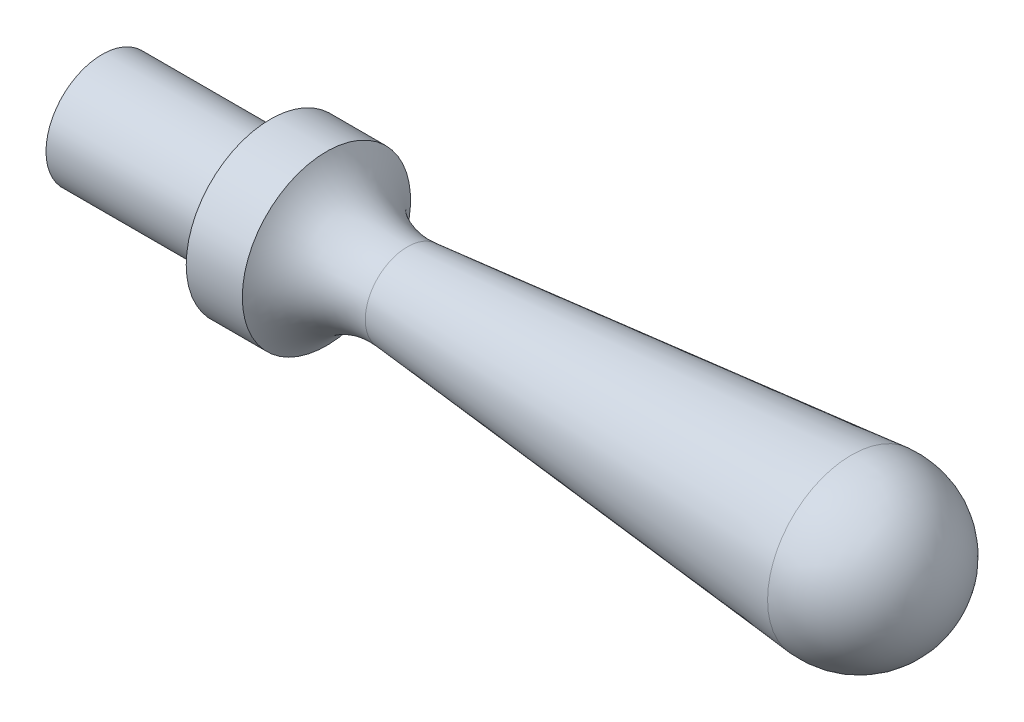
ISO-10303-21;
HEADER;
FILE_DESCRIPTION(('STEP AP214'),'2;1');
FILE_NAME('part.step','',(''),(''),'','','');
FILE_SCHEMA(('AUTOMOTIVE_DESIGN { 1 0 10303 214 1 1 1 1 }'));
ENDSEC;
DATA;
#1=APPLICATION_CONTEXT('core data for automotive mechanical design processes');
#2=APPLICATION_PROTOCOL_DEFINITION('international standard','automotive_design',2000,#1);
#3=PRODUCT_CONTEXT('',#1,'mechanical');
#4=PRODUCT('Part','Part','',(#3));
#5=PRODUCT_RELATED_PRODUCT_CATEGORY('part','',(#4));
#6=PRODUCT_DEFINITION_FORMATION('','',#4);
#7=PRODUCT_DEFINITION_CONTEXT('part definition',#1,'design');
#8=PRODUCT_DEFINITION('design','',#6,#7);
#9=PRODUCT_DEFINITION_SHAPE('','',#8);
#10=(LENGTH_UNIT() NAMED_UNIT(*) SI_UNIT(.MILLI.,.METRE.));
#11=(NAMED_UNIT(*) PLANE_ANGLE_UNIT() SI_UNIT($,.RADIAN.));
#12=(NAMED_UNIT(*) SI_UNIT($,.STERADIAN.) SOLID_ANGLE_UNIT());
#13=UNCERTAINTY_MEASURE_WITH_UNIT(LENGTH_MEASURE(1.E-05),#10,'distance_accuracy_value','');
#14=(GEOMETRIC_REPRESENTATION_CONTEXT(3) GLOBAL_UNCERTAINTY_ASSIGNED_CONTEXT((#13)) GLOBAL_UNIT_ASSIGNED_CONTEXT((#10,
#11,#12)) REPRESENTATION_CONTEXT('',''));
#15=CARTESIAN_POINT('',(0.,0.,0.));
#16=DIRECTION('',(0.,0.,1.));
#17=DIRECTION('',(1.,0.,0.));
#18=AXIS2_PLACEMENT_3D('',#15,#16,#17);
#19=CARTESIAN_POINT('',(0.,0.,0.));
#20=DIRECTION('',(1.,0.,0.));
#21=DIRECTION('',(0.,0.,-1.));
#22=AXIS2_PLACEMENT_3D('',#19,#20,#21);
#23=PLANE('',#22);
#24=CARTESIAN_POINT('',(0.,0.,0.));
#25=DIRECTION('',(-1.,0.,0.));
#26=DIRECTION('',(0.,0.,1.));
#27=AXIS2_PLACEMENT_3D('',#24,#25,#26);
#28=CIRCLE('',#27,2.);
#29=CARTESIAN_POINT('',(0.,0.,2.));
#30=VERTEX_POINT('',#29);
#31=EDGE_CURVE('E10',#30,#30,#28,.T.);
#32=ORIENTED_EDGE('',*,*,#31,.T.);
#33=EDGE_LOOP('',(#32));
#34=FACE_BOUND('',#33,.T.);
#35=ADVANCED_FACE('F31',(#34),#23,.F.);
#36=CARTESIAN_POINT('',(0.,0.,0.));
#37=DIRECTION('',(-1.,0.,0.));
#38=DIRECTION('',(0.,0.,1.));
#39=AXIS2_PLACEMENT_3D('',#36,#37,#38);
#40=CYLINDRICAL_SURFACE('',#39,2.);
#41=ORIENTED_EDGE('',*,*,#31,.F.);
#42=EDGE_LOOP('',(#41));
#43=FACE_BOUND('',#42,.T.);
#44=CARTESIAN_POINT('',(6.,0.,0.));
#45=DIRECTION('',(-1.,0.,0.));
#46=DIRECTION('',(0.,0.,1.));
#47=AXIS2_PLACEMENT_3D('',#44,#45,#46);
#48=CIRCLE('',#47,2.);
#49=CARTESIAN_POINT('',(6.,0.,2.));
#50=VERTEX_POINT('',#49);
#51=EDGE_CURVE('E37',#50,#50,#48,.T.);
#52=ORIENTED_EDGE('',*,*,#51,.T.);
#53=EDGE_LOOP('',(#52));
#54=FACE_BOUND('',#53,.T.);
#55=ADVANCED_FACE('F69',(#43,#54),#40,.T.);
#56=CARTESIAN_POINT('',(6.,2.,0.));
#57=DIRECTION('',(1.,0.,0.));
#58=DIRECTION('',(0.,0.,-1.));
#59=AXIS2_PLACEMENT_3D('',#56,#57,#58);
#60=PLANE('',#59);
#61=ORIENTED_EDGE('',*,*,#51,.F.);
#62=EDGE_LOOP('',(#61));
#63=FACE_BOUND('',#62,.T.);
#64=CARTESIAN_POINT('',(6.,0.,0.));
#65=DIRECTION('',(-1.,0.,0.));
#66=DIRECTION('',(0.,0.,1.));
#67=AXIS2_PLACEMENT_3D('',#64,#65,#66);
#68=CIRCLE('',#67,3.);
#69=CARTESIAN_POINT('',(6.,0.,3.));
#70=VERTEX_POINT('',#69);
#71=EDGE_CURVE('E41',#70,#70,#68,.T.);
#72=ORIENTED_EDGE('',*,*,#71,.T.);
#73=EDGE_LOOP('',(#72));
#74=FACE_BOUND('',#73,.T.);
#75=ADVANCED_FACE('F73',(#63,#74),#60,.F.);
#76=CARTESIAN_POINT('',(0.,0.,0.));
#77=DIRECTION('',(-1.,0.,0.));
#78=DIRECTION('',(0.,0.,1.));
#79=AXIS2_PLACEMENT_3D('',#76,#77,#78);
#80=CYLINDRICAL_SURFACE('',#79,3.);
#81=ORIENTED_EDGE('',*,*,#71,.F.);
#82=EDGE_LOOP('',(#81));
#83=FACE_BOUND('',#82,.T.);
#84=CARTESIAN_POINT('',(8.,0.,0.));
#85=DIRECTION('',(-1.,0.,0.));
#86=DIRECTION('',(0.,0.,1.));
#87=AXIS2_PLACEMENT_3D('',#84,#85,#86);
#88=CIRCLE('',#87,3.);
#89=CARTESIAN_POINT('',(8.,0.,3.));
#90=VERTEX_POINT('',#89);
#91=EDGE_CURVE('E45',#90,#90,#88,.T.);
#92=ORIENTED_EDGE('',*,*,#91,.T.);
#93=EDGE_LOOP('',(#92));
#94=FACE_BOUND('',#93,.T.);
#95=ADVANCED_FACE('F78',(#83,#94),#80,.T.);
#96=CARTESIAN_POINT('',(10.6056188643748,0.,0.));
#97=DIRECTION('',(-1.,0.,0.));
#98=DIRECTION('',(0.,0.,1.));
#99=AXIS2_PLACEMENT_3D('',#96,#97,#98);
#100=TOROIDAL_SURFACE('',#99,4.48685921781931,3.);
#101=ORIENTED_EDGE('',*,*,#91,.F.);
#102=EDGE_LOOP('',(#101));
#103=FACE_BOUND('',#102,.T.);
#104=CARTESIAN_POINT('',(10.8861041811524,0.,0.));
#105=DIRECTION('',(-1.,0.,0.));
#106=DIRECTION('',(0.,0.,1.));
#107=AXIS2_PLACEMENT_3D('',#104,#105,#106);
#108=CIRCLE('',#107,1.5);
#109=CARTESIAN_POINT('',(10.8861041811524,0.,1.5));
#110=VERTEX_POINT('',#109);
#111=EDGE_CURVE('E50',#110,#110,#108,.T.);
#112=ORIENTED_EDGE('',*,*,#111,.T.);
#113=EDGE_LOOP('',(#112));
#114=FACE_BOUND('',#113,.T.);
#115=ADVANCED_FACE('F65',(#103,#114),#100,.F.);
#116=CARTESIAN_POINT('',(26.7195146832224,0.,0.));
#117=DIRECTION('',(1.,0.,0.));
#118=DIRECTION('',(0.,0.,-1.));
#119=AXIS2_PLACEMENT_3D('',#116,#117,#118);
#120=CONICAL_SURFACE('',#119,2.98685921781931,0.093631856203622);
#121=ORIENTED_EDGE('',*,*,#111,.F.);
#122=EDGE_LOOP('',(#121));
#123=FACE_BOUND('',#122,.T.);
#124=CARTESIAN_POINT('',(26.7195146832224,0.,0.));
#125=DIRECTION('',(-1.,0.,0.));
#126=DIRECTION('',(0.,0.,1.));
#127=AXIS2_PLACEMENT_3D('',#124,#125,#126);
#128=CIRCLE('',#127,2.98685921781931);
#129=CARTESIAN_POINT('',(26.7195146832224,0.,2.98685921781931));
#130=VERTEX_POINT('',#129);
#131=EDGE_CURVE('E53',#130,#130,#128,.T.);
#132=ORIENTED_EDGE('',*,*,#131,.T.);
#133=EDGE_LOOP('',(#132));
#134=FACE_BOUND('',#133,.T.);
#135=ADVANCED_FACE('F57',(#123,#134),#120,.T.);
#136=CARTESIAN_POINT('',(27.,0.,0.));
#137=DIRECTION('',(-1.,0.,0.));
#138=DIRECTION('',(0.,1.,0.));
#139=AXIS2_PLACEMENT_3D('',#136,#137,#138);
#140=SPHERICAL_SURFACE('',#139,3.);
#141=ORIENTED_EDGE('',*,*,#131,.F.);
#142=EDGE_LOOP('',(#141));
#143=FACE_BOUND('',#142,.T.);
#144=ADVANCED_FACE('F59',(#143),#140,.T.);
#145=CLOSED_SHELL('',(#35,#55,#75,#95,#115,#135,#144));
#146=MANIFOLD_SOLID_BREP('B2',#145);
#147=ADVANCED_BREP_SHAPE_REPRESENTATION('',(#18,#146),#14);
#148=SHAPE_DEFINITION_REPRESENTATION(#9,#147);
ENDSEC;
END-ISO-10303-21;
